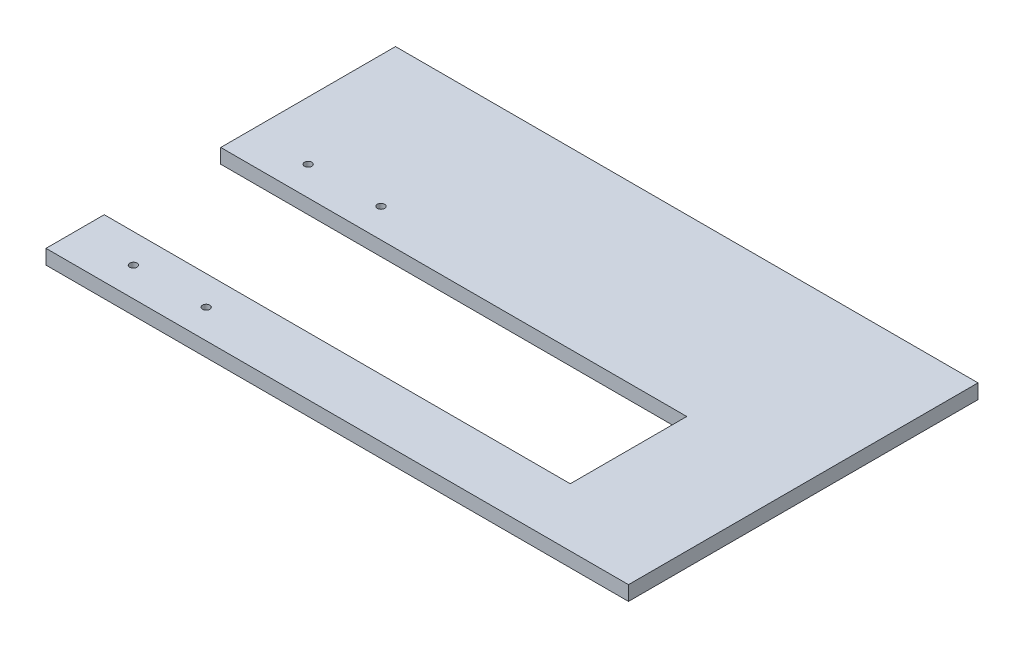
ISO-10303-21;
HEADER;
FILE_DESCRIPTION(('STEP AP214'),'2;1');
FILE_NAME('part.step','',(''),(''),'','','');
FILE_SCHEMA(('AUTOMOTIVE_DESIGN { 1 0 10303 214 1 1 1 1 }'));
ENDSEC;
DATA;
#1=APPLICATION_CONTEXT('core data for automotive mechanical design processes');
#2=APPLICATION_PROTOCOL_DEFINITION('international standard','automotive_design',2000,#1);
#3=PRODUCT_CONTEXT('',#1,'mechanical');
#4=PRODUCT('Part','Part','',(#3));
#5=PRODUCT_RELATED_PRODUCT_CATEGORY('part','',(#4));
#6=PRODUCT_DEFINITION_FORMATION('','',#4);
#7=PRODUCT_DEFINITION_CONTEXT('part definition',#1,'design');
#8=PRODUCT_DEFINITION('design','',#6,#7);
#9=PRODUCT_DEFINITION_SHAPE('','',#8);
#10=(LENGTH_UNIT() NAMED_UNIT(*) SI_UNIT(.MILLI.,.METRE.));
#11=(NAMED_UNIT(*) PLANE_ANGLE_UNIT() SI_UNIT($,.RADIAN.));
#12=(NAMED_UNIT(*) SI_UNIT($,.STERADIAN.) SOLID_ANGLE_UNIT());
#13=UNCERTAINTY_MEASURE_WITH_UNIT(LENGTH_MEASURE(1.E-05),#10,'distance_accuracy_value','');
#14=(GEOMETRIC_REPRESENTATION_CONTEXT(3) GLOBAL_UNCERTAINTY_ASSIGNED_CONTEXT((#13)) GLOBAL_UNIT_ASSIGNED_CONTEXT((#10,
#11,#12)) REPRESENTATION_CONTEXT('',''));
#15=CARTESIAN_POINT('',(0.,0.,0.));
#16=DIRECTION('',(0.,0.,1.));
#17=DIRECTION('',(1.,0.,0.));
#18=AXIS2_PLACEMENT_3D('',#15,#16,#17);
#19=CARTESIAN_POINT('',(0.,6.35,0.));
#20=DIRECTION('',(-1.,0.,0.));
#21=DIRECTION('',(0.,0.,1.));
#22=AXIS2_PLACEMENT_3D('',#19,#20,#21);
#23=PLANE('',#22);
#24=DIRECTION('',(0.,1.,0.));
#25=VECTOR('',#24,1.);
#26=CARTESIAN_POINT('',(0.,0.,-76.2));
#27=LINE('',#26,#25);
#28=CARTESIAN_POINT('',(0.,0.,-76.2));
#29=VERTEX_POINT('',#28);
#30=CARTESIAN_POINT('',(0.,6.35,-76.2));
#31=VERTEX_POINT('',#30);
#32=EDGE_CURVE('E132',#29,#31,#27,.T.);
#33=ORIENTED_EDGE('',*,*,#32,.T.);
#34=DIRECTION('',(0.,0.,-1.));
#35=VECTOR('',#34,1.);
#36=CARTESIAN_POINT('',(0.,6.35,0.));
#37=LINE('',#36,#35);
#38=CARTESIAN_POINT('',(0.,6.35,-152.4));
#39=VERTEX_POINT('',#38);
#40=EDGE_CURVE('E83',#31,#39,#37,.T.);
#41=ORIENTED_EDGE('',*,*,#40,.T.);
#42=DIRECTION('',(0.,-1.,0.));
#43=VECTOR('',#42,1.);
#44=CARTESIAN_POINT('',(0.,6.35,-152.4));
#45=LINE('',#44,#43);
#46=CARTESIAN_POINT('',(0.,0.,-152.4));
#47=VERTEX_POINT('',#46);
#48=EDGE_CURVE('E144',#39,#47,#45,.T.);
#49=ORIENTED_EDGE('',*,*,#48,.T.);
#50=DIRECTION('',(0.,0.,-1.));
#51=VECTOR('',#50,1.);
#52=CARTESIAN_POINT('',(0.,0.,0.));
#53=LINE('',#52,#51);
#54=EDGE_CURVE('E127',#29,#47,#53,.T.);
#55=ORIENTED_EDGE('',*,*,#54,.F.);
#56=EDGE_LOOP('',(#33,#41,#49,#55));
#57=FACE_BOUND('',#56,.T.);
#58=ADVANCED_FACE('F33',(#57),#23,.T.);
#59=DIRECTION('',(0.,1.,0.));
#60=VECTOR('',#59,1.);
#61=CARTESIAN_POINT('',(0.,0.,-25.4));
#62=LINE('',#61,#60);
#63=CARTESIAN_POINT('',(0.,0.,-25.4));
#64=VERTEX_POINT('',#63);
#65=CARTESIAN_POINT('',(0.,6.35,-25.4));
#66=VERTEX_POINT('',#65);
#67=EDGE_CURVE('E110',#64,#66,#62,.T.);
#68=ORIENTED_EDGE('',*,*,#67,.F.);
#69=CARTESIAN_POINT('',(0.,0.,0.));
#70=VERTEX_POINT('',#69);
#71=EDGE_CURVE('E117',#70,#64,#53,.T.);
#72=ORIENTED_EDGE('',*,*,#71,.F.);
#73=DIRECTION('',(0.,-1.,0.));
#74=VECTOR('',#73,1.);
#75=CARTESIAN_POINT('',(0.,6.35,0.));
#76=LINE('',#75,#74);
#77=CARTESIAN_POINT('',(0.,6.35,0.));
#78=VERTEX_POINT('',#77);
#79=EDGE_CURVE('E11',#78,#70,#76,.T.);
#80=ORIENTED_EDGE('',*,*,#79,.F.);
#81=EDGE_CURVE('E119',#78,#66,#37,.T.);
#82=ORIENTED_EDGE('',*,*,#81,.T.);
#83=EDGE_LOOP('',(#68,#72,#80,#82));
#84=FACE_BOUND('',#83,.T.);
#85=ADVANCED_FACE('F35',(#84),#23,.T.);
#86=CARTESIAN_POINT('',(0.,6.35,0.));
#87=DIRECTION('',(0.,0.,-1.));
#88=DIRECTION('',(-1.,0.,0.));
#89=AXIS2_PLACEMENT_3D('',#86,#87,#88);
#90=PLANE('',#89);
#91=DIRECTION('',(1.,0.,0.));
#92=VECTOR('',#91,1.);
#93=CARTESIAN_POINT('',(0.,0.,0.));
#94=LINE('',#93,#92);
#95=CARTESIAN_POINT('',(254.,0.,0.));
#96=VERTEX_POINT('',#95);
#97=EDGE_CURVE('E125',#70,#96,#94,.T.);
#98=ORIENTED_EDGE('',*,*,#97,.T.);
#99=DIRECTION('',(0.,-1.,0.));
#100=VECTOR('',#99,1.);
#101=CARTESIAN_POINT('',(254.,6.35,0.));
#102=LINE('',#101,#100);
#103=CARTESIAN_POINT('',(254.,6.35,0.));
#104=VERTEX_POINT('',#103);
#105=EDGE_CURVE('E42',#104,#96,#102,.T.);
#106=ORIENTED_EDGE('',*,*,#105,.F.);
#107=DIRECTION('',(1.,0.,0.));
#108=VECTOR('',#107,1.);
#109=CARTESIAN_POINT('',(0.,6.35,0.));
#110=LINE('',#109,#108);
#111=EDGE_CURVE('E134',#78,#104,#110,.T.);
#112=ORIENTED_EDGE('',*,*,#111,.F.);
#113=ORIENTED_EDGE('',*,*,#79,.T.);
#114=EDGE_LOOP('',(#98,#106,#112,#113));
#115=FACE_BOUND('',#114,.T.);
#116=ADVANCED_FACE('F183',(#115),#90,.F.);
#117=CARTESIAN_POINT('',(254.,6.35,0.));
#118=DIRECTION('',(-1.,0.,0.));
#119=DIRECTION('',(0.,0.,1.));
#120=AXIS2_PLACEMENT_3D('',#117,#118,#119);
#121=PLANE('',#120);
#122=DIRECTION('',(0.,0.,-1.));
#123=VECTOR('',#122,1.);
#124=CARTESIAN_POINT('',(254.,0.,0.));
#125=LINE('',#124,#123);
#126=CARTESIAN_POINT('',(254.,0.,-152.4));
#127=VERTEX_POINT('',#126);
#128=EDGE_CURVE('E130',#96,#127,#125,.T.);
#129=ORIENTED_EDGE('',*,*,#128,.T.);
#130=DIRECTION('',(0.,-1.,0.));
#131=VECTOR('',#130,1.);
#132=CARTESIAN_POINT('',(254.,6.35,-152.4));
#133=LINE('',#132,#131);
#134=CARTESIAN_POINT('',(254.,6.35,-152.4));
#135=VERTEX_POINT('',#134);
#136=EDGE_CURVE('E142',#135,#127,#133,.T.);
#137=ORIENTED_EDGE('',*,*,#136,.F.);
#138=DIRECTION('',(0.,0.,-1.));
#139=VECTOR('',#138,1.);
#140=CARTESIAN_POINT('',(254.,6.35,0.));
#141=LINE('',#140,#139);
#142=EDGE_CURVE('E176',#104,#135,#141,.T.);
#143=ORIENTED_EDGE('',*,*,#142,.F.);
#144=ORIENTED_EDGE('',*,*,#105,.T.);
#145=EDGE_LOOP('',(#129,#137,#143,#144));
#146=FACE_BOUND('',#145,.T.);
#147=ADVANCED_FACE('F185',(#146),#121,.F.);
#148=CARTESIAN_POINT('',(0.,6.35,-152.4));
#149=DIRECTION('',(0.,0.,-1.));
#150=DIRECTION('',(-1.,0.,0.));
#151=AXIS2_PLACEMENT_3D('',#148,#149,#150);
#152=PLANE('',#151);
#153=DIRECTION('',(1.,0.,0.));
#154=VECTOR('',#153,1.);
#155=CARTESIAN_POINT('',(0.,0.,-152.4));
#156=LINE('',#155,#154);
#157=EDGE_CURVE('E126',#47,#127,#156,.T.);
#158=ORIENTED_EDGE('',*,*,#157,.F.);
#159=ORIENTED_EDGE('',*,*,#48,.F.);
#160=DIRECTION('',(1.,0.,0.));
#161=VECTOR('',#160,1.);
#162=CARTESIAN_POINT('',(0.,6.35,-152.4));
#163=LINE('',#162,#161);
#164=EDGE_CURVE('E174',#39,#135,#163,.T.);
#165=ORIENTED_EDGE('',*,*,#164,.T.);
#166=ORIENTED_EDGE('',*,*,#136,.T.);
#167=EDGE_LOOP('',(#158,#159,#165,#166));
#168=FACE_BOUND('',#167,.T.);
#169=ADVANCED_FACE('F188',(#168),#152,.T.);
#170=CARTESIAN_POINT('',(0.,6.35,0.));
#171=DIRECTION('',(0.,-1.,0.));
#172=DIRECTION('',(0.,0.,-1.));
#173=AXIS2_PLACEMENT_3D('',#170,#171,#172);
#174=PLANE('',#173);
#175=CARTESIAN_POINT('',(57.15,6.35,-88.9));
#176=DIRECTION('',(0.,1.,0.));
#177=DIRECTION('',(0.,0.,1.));
#178=AXIS2_PLACEMENT_3D('',#175,#176,#177);
#179=CIRCLE('',#178,1.5875);
#180=CARTESIAN_POINT('',(57.15,6.35,-87.3125));
#181=VERTEX_POINT('',#180);
#182=EDGE_CURVE('E197',#181,#181,#179,.T.);
#183=ORIENTED_EDGE('',*,*,#182,.F.);
#184=EDGE_LOOP('',(#183));
#185=FACE_BOUND('',#184,.T.);
#186=CARTESIAN_POINT('',(25.4,6.35,-12.7));
#187=DIRECTION('',(0.,1.,0.));
#188=DIRECTION('',(0.,0.,1.));
#189=AXIS2_PLACEMENT_3D('',#186,#187,#188);
#190=CIRCLE('',#189,1.5875);
#191=CARTESIAN_POINT('',(25.4,6.35,-11.1125));
#192=VERTEX_POINT('',#191);
#193=EDGE_CURVE('E198',#192,#192,#190,.T.);
#194=ORIENTED_EDGE('',*,*,#193,.F.);
#195=EDGE_LOOP('',(#194));
#196=FACE_BOUND('',#195,.T.);
#197=CARTESIAN_POINT('',(57.15,6.35,-12.7));
#198=DIRECTION('',(0.,1.,0.));
#199=DIRECTION('',(0.,0.,1.));
#200=AXIS2_PLACEMENT_3D('',#197,#198,#199);
#201=CIRCLE('',#200,1.5875);
#202=CARTESIAN_POINT('',(57.15,6.35,-11.1125));
#203=VERTEX_POINT('',#202);
#204=EDGE_CURVE('E201',#203,#203,#201,.T.);
#205=ORIENTED_EDGE('',*,*,#204,.F.);
#206=EDGE_LOOP('',(#205));
#207=FACE_BOUND('',#206,.T.);
#208=CARTESIAN_POINT('',(25.4,6.35,-88.9));
#209=DIRECTION('',(0.,1.,0.));
#210=DIRECTION('',(0.,0.,1.));
#211=AXIS2_PLACEMENT_3D('',#208,#209,#210);
#212=CIRCLE('',#211,1.5875);
#213=CARTESIAN_POINT('',(25.4,6.35,-87.3125));
#214=VERTEX_POINT('',#213);
#215=EDGE_CURVE('E150',#214,#214,#212,.T.);
#216=ORIENTED_EDGE('',*,*,#215,.F.);
#217=EDGE_LOOP('',(#216));
#218=FACE_BOUND('',#217,.T.);
#219=ORIENTED_EDGE('',*,*,#40,.F.);
#220=DIRECTION('',(-1.,0.,0.));
#221=VECTOR('',#220,1.);
#222=CARTESIAN_POINT('',(0.,6.35,-76.2));
#223=LINE('',#222,#221);
#224=CARTESIAN_POINT('',(203.2,6.35,-76.2));
#225=VERTEX_POINT('',#224);
#226=EDGE_CURVE('E115',#225,#31,#223,.T.);
#227=ORIENTED_EDGE('',*,*,#226,.F.);
#228=DIRECTION('',(0.,0.,-1.));
#229=VECTOR('',#228,1.);
#230=CARTESIAN_POINT('',(203.2,6.35,-76.2));
#231=LINE('',#230,#229);
#232=CARTESIAN_POINT('',(203.2,6.35,-25.4));
#233=VERTEX_POINT('',#232);
#234=EDGE_CURVE('E160',#233,#225,#231,.T.);
#235=ORIENTED_EDGE('',*,*,#234,.F.);
#236=DIRECTION('',(1.,0.,0.));
#237=VECTOR('',#236,1.);
#238=CARTESIAN_POINT('',(0.,6.35,-25.4));
#239=LINE('',#238,#237);
#240=EDGE_CURVE('E157',#66,#233,#239,.T.);
#241=ORIENTED_EDGE('',*,*,#240,.F.);
#242=ORIENTED_EDGE('',*,*,#81,.F.);
#243=ORIENTED_EDGE('',*,*,#111,.T.);
#244=ORIENTED_EDGE('',*,*,#142,.T.);
#245=ORIENTED_EDGE('',*,*,#164,.F.);
#246=EDGE_LOOP('',(#219,#227,#235,#241,#242,#243,#244,#245));
#247=FACE_BOUND('',#246,.T.);
#248=ADVANCED_FACE('F182',(#185,#196,#207,#218,#247),#174,.F.);
#249=CARTESIAN_POINT('',(0.,0.,0.));
#250=DIRECTION('',(0.,-1.,0.));
#251=DIRECTION('',(0.,0.,-1.));
#252=AXIS2_PLACEMENT_3D('',#249,#250,#251);
#253=PLANE('',#252);
#254=CARTESIAN_POINT('',(57.15,0.,-88.9));
#255=DIRECTION('',(0.,-1.,0.));
#256=DIRECTION('',(0.,0.,-1.));
#257=AXIS2_PLACEMENT_3D('',#254,#255,#256);
#258=CIRCLE('',#257,1.5875);
#259=CARTESIAN_POINT('',(57.15,0.,-90.4875));
#260=VERTEX_POINT('',#259);
#261=EDGE_CURVE('E37',#260,#260,#258,.T.);
#262=ORIENTED_EDGE('',*,*,#261,.F.);
#263=EDGE_LOOP('',(#262));
#264=FACE_BOUND('',#263,.T.);
#265=CARTESIAN_POINT('',(25.4,0.,-12.7));
#266=DIRECTION('',(0.,-1.,0.));
#267=DIRECTION('',(0.,0.,-1.));
#268=AXIS2_PLACEMENT_3D('',#265,#266,#267);
#269=CIRCLE('',#268,1.5875);
#270=CARTESIAN_POINT('',(25.4,0.,-14.2875));
#271=VERTEX_POINT('',#270);
#272=EDGE_CURVE('E152',#271,#271,#269,.T.);
#273=ORIENTED_EDGE('',*,*,#272,.F.);
#274=EDGE_LOOP('',(#273));
#275=FACE_BOUND('',#274,.T.);
#276=CARTESIAN_POINT('',(57.15,0.,-12.7));
#277=DIRECTION('',(0.,-1.,0.));
#278=DIRECTION('',(0.,0.,-1.));
#279=AXIS2_PLACEMENT_3D('',#276,#277,#278);
#280=CIRCLE('',#279,1.5875);
#281=CARTESIAN_POINT('',(57.15,0.,-14.2875));
#282=VERTEX_POINT('',#281);
#283=EDGE_CURVE('E149',#282,#282,#280,.T.);
#284=ORIENTED_EDGE('',*,*,#283,.F.);
#285=EDGE_LOOP('',(#284));
#286=FACE_BOUND('',#285,.T.);
#287=CARTESIAN_POINT('',(25.4,0.,-88.9));
#288=DIRECTION('',(0.,-1.,0.));
#289=DIRECTION('',(0.,0.,-1.));
#290=AXIS2_PLACEMENT_3D('',#287,#288,#289);
#291=CIRCLE('',#290,1.5875);
#292=CARTESIAN_POINT('',(25.4,0.,-90.4875));
#293=VERTEX_POINT('',#292);
#294=EDGE_CURVE('E146',#293,#293,#291,.T.);
#295=ORIENTED_EDGE('',*,*,#294,.F.);
#296=EDGE_LOOP('',(#295));
#297=FACE_BOUND('',#296,.T.);
#298=DIRECTION('',(-1.,0.,0.));
#299=VECTOR('',#298,1.);
#300=CARTESIAN_POINT('',(0.,0.,-76.2));
#301=LINE('',#300,#299);
#302=CARTESIAN_POINT('',(203.2,0.,-76.2));
#303=VERTEX_POINT('',#302);
#304=EDGE_CURVE('E120',#303,#29,#301,.T.);
#305=ORIENTED_EDGE('',*,*,#304,.T.);
#306=ORIENTED_EDGE('',*,*,#54,.T.);
#307=ORIENTED_EDGE('',*,*,#157,.T.);
#308=ORIENTED_EDGE('',*,*,#128,.F.);
#309=ORIENTED_EDGE('',*,*,#97,.F.);
#310=ORIENTED_EDGE('',*,*,#71,.T.);
#311=DIRECTION('',(1.,0.,0.));
#312=VECTOR('',#311,1.);
#313=CARTESIAN_POINT('',(0.,0.,-25.4));
#314=LINE('',#313,#312);
#315=CARTESIAN_POINT('',(203.2,0.,-25.4));
#316=VERTEX_POINT('',#315);
#317=EDGE_CURVE('E106',#64,#316,#314,.T.);
#318=ORIENTED_EDGE('',*,*,#317,.T.);
#319=DIRECTION('',(0.,0.,-1.));
#320=VECTOR('',#319,1.);
#321=CARTESIAN_POINT('',(203.2,0.,-76.2));
#322=LINE('',#321,#320);
#323=EDGE_CURVE('E50',#316,#303,#322,.T.);
#324=ORIENTED_EDGE('',*,*,#323,.T.);
#325=EDGE_LOOP('',(#305,#306,#307,#308,#309,#310,#318,#324));
#326=FACE_BOUND('',#325,.T.);
#327=ADVANCED_FACE('F123',(#264,#275,#286,#297,#326),#253,.T.);
#328=CARTESIAN_POINT('',(0.,0.,-76.2));
#329=DIRECTION('',(0.,0.,-1.));
#330=DIRECTION('',(-1.,0.,0.));
#331=AXIS2_PLACEMENT_3D('',#328,#329,#330);
#332=PLANE('',#331);
#333=ORIENTED_EDGE('',*,*,#226,.T.);
#334=ORIENTED_EDGE('',*,*,#32,.F.);
#335=ORIENTED_EDGE('',*,*,#304,.F.);
#336=DIRECTION('',(0.,1.,0.));
#337=VECTOR('',#336,1.);
#338=CARTESIAN_POINT('',(203.2,0.,-76.2));
#339=LINE('',#338,#337);
#340=EDGE_CURVE('E170',#303,#225,#339,.T.);
#341=ORIENTED_EDGE('',*,*,#340,.T.);
#342=EDGE_LOOP('',(#333,#334,#335,#341));
#343=FACE_BOUND('',#342,.T.);
#344=ADVANCED_FACE('F191',(#343),#332,.F.);
#345=CARTESIAN_POINT('',(203.2,0.,-76.2));
#346=DIRECTION('',(1.,0.,0.));
#347=DIRECTION('',(0.,0.,-1.));
#348=AXIS2_PLACEMENT_3D('',#345,#346,#347);
#349=PLANE('',#348);
#350=ORIENTED_EDGE('',*,*,#234,.T.);
#351=ORIENTED_EDGE('',*,*,#340,.F.);
#352=ORIENTED_EDGE('',*,*,#323,.F.);
#353=DIRECTION('',(0.,1.,0.));
#354=VECTOR('',#353,1.);
#355=CARTESIAN_POINT('',(203.2,0.,-25.4));
#356=LINE('',#355,#354);
#357=EDGE_CURVE('E112',#316,#233,#356,.T.);
#358=ORIENTED_EDGE('',*,*,#357,.T.);
#359=EDGE_LOOP('',(#350,#351,#352,#358));
#360=FACE_BOUND('',#359,.T.);
#361=ADVANCED_FACE('F226',(#360),#349,.F.);
#362=CARTESIAN_POINT('',(0.,0.,-25.4));
#363=DIRECTION('',(0.,0.,1.));
#364=DIRECTION('',(1.,0.,0.));
#365=AXIS2_PLACEMENT_3D('',#362,#363,#364);
#366=PLANE('',#365);
#367=ORIENTED_EDGE('',*,*,#240,.T.);
#368=ORIENTED_EDGE('',*,*,#357,.F.);
#369=ORIENTED_EDGE('',*,*,#317,.F.);
#370=ORIENTED_EDGE('',*,*,#67,.T.);
#371=EDGE_LOOP('',(#367,#368,#369,#370));
#372=FACE_BOUND('',#371,.T.);
#373=ADVANCED_FACE('F109',(#372),#366,.F.);
#374=CARTESIAN_POINT('',(25.4,-19.05,-88.9));
#375=DIRECTION('',(0.,1.,0.));
#376=DIRECTION('',(0.,0.,1.));
#377=AXIS2_PLACEMENT_3D('',#374,#375,#376);
#378=CYLINDRICAL_SURFACE('',#377,1.5875);
#379=ORIENTED_EDGE('',*,*,#294,.T.);
#380=EDGE_LOOP('',(#379));
#381=FACE_BOUND('',#380,.T.);
#382=ORIENTED_EDGE('',*,*,#215,.T.);
#383=EDGE_LOOP('',(#382));
#384=FACE_BOUND('',#383,.T.);
#385=ADVANCED_FACE('F215',(#381,#384),#378,.F.);
#386=CARTESIAN_POINT('',(57.15,-19.05,-12.7));
#387=DIRECTION('',(0.,1.,0.));
#388=DIRECTION('',(0.,0.,1.));
#389=AXIS2_PLACEMENT_3D('',#386,#387,#388);
#390=CYLINDRICAL_SURFACE('',#389,1.5875);
#391=ORIENTED_EDGE('',*,*,#283,.T.);
#392=EDGE_LOOP('',(#391));
#393=FACE_BOUND('',#392,.T.);
#394=ORIENTED_EDGE('',*,*,#204,.T.);
#395=EDGE_LOOP('',(#394));
#396=FACE_BOUND('',#395,.T.);
#397=ADVANCED_FACE('F207',(#393,#396),#390,.F.);
#398=CARTESIAN_POINT('',(25.4,-19.05,-12.7));
#399=DIRECTION('',(0.,1.,0.));
#400=DIRECTION('',(0.,0.,1.));
#401=AXIS2_PLACEMENT_3D('',#398,#399,#400);
#402=CYLINDRICAL_SURFACE('',#401,1.5875);
#403=ORIENTED_EDGE('',*,*,#272,.T.);
#404=EDGE_LOOP('',(#403));
#405=FACE_BOUND('',#404,.T.);
#406=ORIENTED_EDGE('',*,*,#193,.T.);
#407=EDGE_LOOP('',(#406));
#408=FACE_BOUND('',#407,.T.);
#409=ADVANCED_FACE('F223',(#405,#408),#402,.F.);
#410=CARTESIAN_POINT('',(57.15,-19.05,-88.9));
#411=DIRECTION('',(0.,1.,0.));
#412=DIRECTION('',(0.,0.,1.));
#413=AXIS2_PLACEMENT_3D('',#410,#411,#412);
#414=CYLINDRICAL_SURFACE('',#413,1.5875);
#415=ORIENTED_EDGE('',*,*,#261,.T.);
#416=EDGE_LOOP('',(#415));
#417=FACE_BOUND('',#416,.T.);
#418=ORIENTED_EDGE('',*,*,#182,.T.);
#419=EDGE_LOOP('',(#418));
#420=FACE_BOUND('',#419,.T.);
#421=ADVANCED_FACE('F299',(#417,#420),#414,.F.);
#422=CLOSED_SHELL('',(#58,#85,#116,#147,#169,#248,#327,#344,#361,#373,#385,#397,#409,#421));
#423=MANIFOLD_SOLID_BREP('B2',#422);
#424=ADVANCED_BREP_SHAPE_REPRESENTATION('',(#18,#423),#14);
#425=SHAPE_DEFINITION_REPRESENTATION(#9,#424);
ENDSEC;
END-ISO-10303-21;
